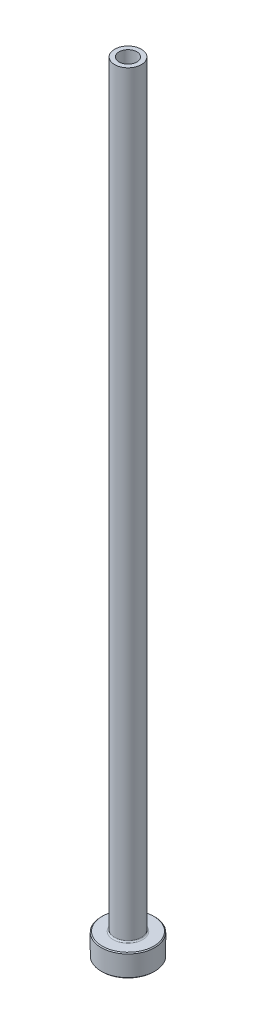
ISO-10303-21;
HEADER;
FILE_DESCRIPTION(('STEP AP214'),'2;1');
FILE_NAME('part.step','',(''),(''),'','','');
FILE_SCHEMA(('AUTOMOTIVE_DESIGN { 1 0 10303 214 1 1 1 1 }'));
ENDSEC;
DATA;
#1=APPLICATION_CONTEXT('core data for automotive mechanical design processes');
#2=APPLICATION_PROTOCOL_DEFINITION('international standard','automotive_design',2000,#1);
#3=PRODUCT_CONTEXT('',#1,'mechanical');
#4=PRODUCT('Part','Part','',(#3));
#5=PRODUCT_RELATED_PRODUCT_CATEGORY('part','',(#4));
#6=PRODUCT_DEFINITION_FORMATION('','',#4);
#7=PRODUCT_DEFINITION_CONTEXT('part definition',#1,'design');
#8=PRODUCT_DEFINITION('design','',#6,#7);
#9=PRODUCT_DEFINITION_SHAPE('','',#8);
#10=(LENGTH_UNIT() NAMED_UNIT(*) SI_UNIT(.MILLI.,.METRE.));
#11=(NAMED_UNIT(*) PLANE_ANGLE_UNIT() SI_UNIT($,.RADIAN.));
#12=(NAMED_UNIT(*) SI_UNIT($,.STERADIAN.) SOLID_ANGLE_UNIT());
#13=UNCERTAINTY_MEASURE_WITH_UNIT(LENGTH_MEASURE(1.E-05),#10,'distance_accuracy_value','');
#14=(GEOMETRIC_REPRESENTATION_CONTEXT(3) GLOBAL_UNCERTAINTY_ASSIGNED_CONTEXT((#13)) GLOBAL_UNIT_ASSIGNED_CONTEXT((#10,
#11,#12)) REPRESENTATION_CONTEXT('',''));
#15=CARTESIAN_POINT('',(0.,0.,0.));
#16=DIRECTION('',(0.,0.,1.));
#17=DIRECTION('',(1.,0.,0.));
#18=AXIS2_PLACEMENT_3D('',#15,#16,#17);
#19=CARTESIAN_POINT('',(0.,92.1876809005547,0.));
#20=DIRECTION('',(0.,1.,0.));
#21=DIRECTION('',(0.,0.,1.));
#22=AXIS2_PLACEMENT_3D('',#19,#20,#21);
#23=CYLINDRICAL_SURFACE('',#22,2.);
#24=CARTESIAN_POINT('',(0.,175.,0.));
#25=DIRECTION('',(0.,1.,0.));
#26=DIRECTION('',(0.,0.,1.));
#27=AXIS2_PLACEMENT_3D('',#24,#25,#26);
#28=CIRCLE('',#27,2.);
#29=CARTESIAN_POINT('',(0.,175.,2.));
#30=VERTEX_POINT('',#29);
#31=EDGE_CURVE('E62',#30,#30,#28,.T.);
#32=ORIENTED_EDGE('',*,*,#31,.T.);
#33=EDGE_LOOP('',(#32));
#34=FACE_BOUND('',#33,.T.);
#35=CARTESIAN_POINT('',(0.,130.,0.));
#36=DIRECTION('',(0.,1.,0.));
#37=DIRECTION('',(0.,0.,1.));
#38=AXIS2_PLACEMENT_3D('',#35,#36,#37);
#39=CIRCLE('',#38,2.);
#40=CARTESIAN_POINT('',(0.,130.,2.));
#41=VERTEX_POINT('',#40);
#42=EDGE_CURVE('E71',#41,#41,#39,.T.);
#43=ORIENTED_EDGE('',*,*,#42,.F.);
#44=EDGE_LOOP('',(#43));
#45=FACE_BOUND('',#44,.T.);
#46=ADVANCED_FACE('F30',(#34,#45),#23,.F.);
#47=CARTESIAN_POINT('',(-2.,175.,0.));
#48=DIRECTION('',(0.,1.,0.));
#49=DIRECTION('',(0.,0.,1.));
#50=AXIS2_PLACEMENT_3D('',#47,#48,#49);
#51=PLANE('',#50);
#52=CARTESIAN_POINT('',(0.,175.,0.));
#53=DIRECTION('',(0.,1.,0.));
#54=DIRECTION('',(0.,0.,1.));
#55=AXIS2_PLACEMENT_3D('',#52,#53,#54);
#56=CIRCLE('',#55,3.00000000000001);
#57=CARTESIAN_POINT('',(0.,175.,3.00000000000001));
#58=VERTEX_POINT('',#57);
#59=EDGE_CURVE('E65',#58,#58,#56,.T.);
#60=ORIENTED_EDGE('',*,*,#59,.T.);
#61=EDGE_LOOP('',(#60));
#62=FACE_BOUND('',#61,.T.);
#63=ORIENTED_EDGE('',*,*,#31,.F.);
#64=EDGE_LOOP('',(#63));
#65=FACE_BOUND('',#64,.T.);
#66=ADVANCED_FACE('F79',(#62,#65),#51,.T.);
#67=CARTESIAN_POINT('',(0.,92.1876809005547,0.));
#68=DIRECTION('',(0.,1.,0.));
#69=DIRECTION('',(0.,0.,1.));
#70=AXIS2_PLACEMENT_3D('',#67,#68,#69);
#71=CYLINDRICAL_SURFACE('',#70,3.);
#72=CARTESIAN_POINT('',(0.,5.3,0.));
#73=DIRECTION('',(0.,1.,0.));
#74=DIRECTION('',(0.,0.,1.));
#75=AXIS2_PLACEMENT_3D('',#72,#73,#74);
#76=CIRCLE('',#75,3.);
#77=CARTESIAN_POINT('',(0.,5.3,3.));
#78=VERTEX_POINT('',#77);
#79=EDGE_CURVE('E59',#78,#78,#76,.T.);
#80=ORIENTED_EDGE('',*,*,#79,.T.);
#81=EDGE_LOOP('',(#80));
#82=FACE_BOUND('',#81,.T.);
#83=ORIENTED_EDGE('',*,*,#59,.F.);
#84=EDGE_LOOP('',(#83));
#85=FACE_BOUND('',#84,.T.);
#86=ADVANCED_FACE('F85',(#82,#85),#71,.T.);
#87=CARTESIAN_POINT('',(-2.99999999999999,5.,0.));
#88=DIRECTION('',(0.,1.,0.));
#89=DIRECTION('',(0.,0.,1.));
#90=AXIS2_PLACEMENT_3D('',#87,#88,#89);
#91=PLANE('',#90);
#92=CARTESIAN_POINT('',(0.,5.,0.));
#93=DIRECTION('',(0.,1.,0.));
#94=DIRECTION('',(0.,0.,1.));
#95=AXIS2_PLACEMENT_3D('',#92,#93,#94);
#96=CIRCLE('',#95,5.79999999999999);
#97=CARTESIAN_POINT('',(0.,5.,5.79999999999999));
#98=VERTEX_POINT('',#97);
#99=EDGE_CURVE('E53',#98,#98,#96,.T.);
#100=ORIENTED_EDGE('',*,*,#99,.T.);
#101=EDGE_LOOP('',(#100));
#102=FACE_BOUND('',#101,.T.);
#103=CARTESIAN_POINT('',(0.,5.,0.));
#104=DIRECTION('',(0.,1.,0.));
#105=DIRECTION('',(0.,0.,1.));
#106=AXIS2_PLACEMENT_3D('',#103,#104,#105);
#107=CIRCLE('',#106,3.3);
#108=CARTESIAN_POINT('',(0.,5.,3.3));
#109=VERTEX_POINT('',#108);
#110=EDGE_CURVE('E56',#109,#109,#107,.F.);
#111=ORIENTED_EDGE('',*,*,#110,.T.);
#112=EDGE_LOOP('',(#111));
#113=FACE_BOUND('',#112,.T.);
#114=ADVANCED_FACE('F111',(#102,#113),#91,.T.);
#115=CARTESIAN_POINT('',(0.,92.1876809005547,0.));
#116=DIRECTION('',(0.,1.,0.));
#117=DIRECTION('',(0.,0.,1.));
#118=AXIS2_PLACEMENT_3D('',#115,#116,#117);
#119=CYLINDRICAL_SURFACE('',#118,5.99999999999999);
#120=CARTESIAN_POINT('',(0.,4.8,0.));
#121=DIRECTION('',(0.,1.,0.));
#122=DIRECTION('',(0.,0.,1.));
#123=AXIS2_PLACEMENT_3D('',#120,#121,#122);
#124=CIRCLE('',#123,5.99999999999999);
#125=CARTESIAN_POINT('',(0.,4.8,5.99999999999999));
#126=VERTEX_POINT('',#125);
#127=EDGE_CURVE('E45',#126,#126,#124,.F.);
#128=ORIENTED_EDGE('',*,*,#127,.T.);
#129=EDGE_LOOP('',(#128));
#130=FACE_BOUND('',#129,.T.);
#131=CARTESIAN_POINT('',(0.,0.200000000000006,0.));
#132=DIRECTION('',(0.,-1.,0.));
#133=DIRECTION('',(0.,0.,-1.));
#134=AXIS2_PLACEMENT_3D('',#131,#132,#133);
#135=CIRCLE('',#134,5.99999999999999);
#136=CARTESIAN_POINT('',(0.,0.200000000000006,-5.99999999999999));
#137=VERTEX_POINT('',#136);
#138=EDGE_CURVE('E50',#137,#137,#135,.F.);
#139=ORIENTED_EDGE('',*,*,#138,.T.);
#140=EDGE_LOOP('',(#139));
#141=FACE_BOUND('',#140,.T.);
#142=ADVANCED_FACE('F108',(#130,#141),#119,.T.);
#143=CARTESIAN_POINT('',(-5.99999999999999,0.,0.));
#144=DIRECTION('',(0.,-1.,0.));
#145=DIRECTION('',(0.,0.,-1.));
#146=AXIS2_PLACEMENT_3D('',#143,#144,#145);
#147=PLANE('',#146);
#148=CARTESIAN_POINT('',(0.,0.,0.));
#149=DIRECTION('',(0.,-1.,0.));
#150=DIRECTION('',(0.,0.,-1.));
#151=AXIS2_PLACEMENT_3D('',#148,#149,#150);
#152=CIRCLE('',#151,2.74999999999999);
#153=CARTESIAN_POINT('',(0.,0.,-2.74999999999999));
#154=VERTEX_POINT('',#153);
#155=EDGE_CURVE('E37',#154,#154,#152,.F.);
#156=ORIENTED_EDGE('',*,*,#155,.T.);
#157=EDGE_LOOP('',(#156));
#158=FACE_BOUND('',#157,.T.);
#159=CARTESIAN_POINT('',(0.,0.,0.));
#160=DIRECTION('',(0.,-1.,0.));
#161=DIRECTION('',(0.,0.,-1.));
#162=AXIS2_PLACEMENT_3D('',#159,#160,#161);
#163=CIRCLE('',#162,5.79999999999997);
#164=CARTESIAN_POINT('',(0.,0.,-5.79999999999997));
#165=VERTEX_POINT('',#164);
#166=EDGE_CURVE('E41',#165,#165,#163,.T.);
#167=ORIENTED_EDGE('',*,*,#166,.T.);
#168=EDGE_LOOP('',(#167));
#169=FACE_BOUND('',#168,.T.);
#170=ADVANCED_FACE('F110',(#158,#169),#147,.T.);
#171=CARTESIAN_POINT('',(0.,92.1876809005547,0.));
#172=DIRECTION('',(0.,1.,0.));
#173=DIRECTION('',(0.,0.,1.));
#174=AXIS2_PLACEMENT_3D('',#171,#172,#173);
#175=CYLINDRICAL_SURFACE('',#174,2.25);
#176=CARTESIAN_POINT('',(0.,0.5,0.));
#177=DIRECTION('',(0.,-1.,0.));
#178=DIRECTION('',(0.,0.,-1.));
#179=AXIS2_PLACEMENT_3D('',#176,#177,#178);
#180=CIRCLE('',#179,2.25);
#181=CARTESIAN_POINT('',(0.,0.5,-2.25));
#182=VERTEX_POINT('',#181);
#183=EDGE_CURVE('E10',#182,#182,#180,.T.);
#184=ORIENTED_EDGE('',*,*,#183,.T.);
#185=EDGE_LOOP('',(#184));
#186=FACE_BOUND('',#185,.T.);
#187=CARTESIAN_POINT('',(0.,118.,0.));
#188=DIRECTION('',(0.,1.,0.));
#189=DIRECTION('',(0.,0.,1.));
#190=AXIS2_PLACEMENT_3D('',#187,#188,#189);
#191=CIRCLE('',#190,2.25);
#192=CARTESIAN_POINT('',(0.,118.,2.25));
#193=VERTEX_POINT('',#192);
#194=EDGE_CURVE('E68',#193,#193,#191,.T.);
#195=ORIENTED_EDGE('',*,*,#194,.T.);
#196=EDGE_LOOP('',(#195));
#197=FACE_BOUND('',#196,.T.);
#198=ADVANCED_FACE('F118',(#186,#197),#175,.F.);
#199=CARTESIAN_POINT('',(0.,118.,0.));
#200=DIRECTION('',(0.,-1.,0.));
#201=DIRECTION('',(0.,0.,-1.));
#202=AXIS2_PLACEMENT_3D('',#199,#200,#201);
#203=CONICAL_SURFACE('',#202,2.25,0.0208303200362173);
#204=ORIENTED_EDGE('',*,*,#42,.T.);
#205=EDGE_LOOP('',(#204));
#206=FACE_BOUND('',#205,.T.);
#207=ORIENTED_EDGE('',*,*,#194,.F.);
#208=EDGE_LOOP('',(#207));
#209=FACE_BOUND('',#208,.T.);
#210=ADVANCED_FACE('F75',(#206,#209),#203,.F.);
#211=CARTESIAN_POINT('',(0.,5.3,0.));
#212=DIRECTION('',(0.,1.,0.));
#213=DIRECTION('',(0.,0.,1.));
#214=AXIS2_PLACEMENT_3D('',#211,#212,#213);
#215=TOROIDAL_SURFACE('',#214,3.3,0.3);
#216=ORIENTED_EDGE('',*,*,#110,.F.);
#217=EDGE_LOOP('',(#216));
#218=FACE_BOUND('',#217,.T.);
#219=ORIENTED_EDGE('',*,*,#79,.F.);
#220=EDGE_LOOP('',(#219));
#221=FACE_BOUND('',#220,.T.);
#222=ADVANCED_FACE('F90',(#218,#221),#215,.F.);
#223=CARTESIAN_POINT('',(0.,5.,0.));
#224=DIRECTION('',(0.,-1.,0.));
#225=DIRECTION('',(0.,0.,-1.));
#226=AXIS2_PLACEMENT_3D('',#223,#224,#225);
#227=CONICAL_SURFACE('',#226,5.79999999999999,0.785398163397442);
#228=ORIENTED_EDGE('',*,*,#127,.F.);
#229=EDGE_LOOP('',(#228));
#230=FACE_BOUND('',#229,.T.);
#231=ORIENTED_EDGE('',*,*,#99,.F.);
#232=EDGE_LOOP('',(#231));
#233=FACE_BOUND('',#232,.T.);
#234=ADVANCED_FACE('F93',(#230,#233),#227,.T.);
#235=CARTESIAN_POINT('',(0.,0.200000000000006,0.));
#236=DIRECTION('',(0.,1.,0.));
#237=DIRECTION('',(0.,0.,1.));
#238=AXIS2_PLACEMENT_3D('',#235,#236,#237);
#239=CONICAL_SURFACE('',#238,5.99999999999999,0.785398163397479);
#240=ORIENTED_EDGE('',*,*,#166,.F.);
#241=EDGE_LOOP('',(#240));
#242=FACE_BOUND('',#241,.T.);
#243=ORIENTED_EDGE('',*,*,#138,.F.);
#244=EDGE_LOOP('',(#243));
#245=FACE_BOUND('',#244,.T.);
#246=ADVANCED_FACE('F96',(#242,#245),#239,.T.);
#247=CARTESIAN_POINT('',(0.,0.,0.));
#248=DIRECTION('',(0.,-1.,0.));
#249=DIRECTION('',(0.,0.,-1.));
#250=AXIS2_PLACEMENT_3D('',#247,#248,#249);
#251=CONICAL_SURFACE('',#250,2.74999999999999,0.785398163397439);
#252=ORIENTED_EDGE('',*,*,#183,.F.);
#253=EDGE_LOOP('',(#252));
#254=FACE_BOUND('',#253,.T.);
#255=ORIENTED_EDGE('',*,*,#155,.F.);
#256=EDGE_LOOP('',(#255));
#257=FACE_BOUND('',#256,.T.);
#258=ADVANCED_FACE('F32',(#254,#257),#251,.F.);
#259=CLOSED_SHELL('',(#46,#66,#86,#114,#142,#170,#198,#210,#222,#234,#246,#258));
#260=MANIFOLD_SOLID_BREP('B2',#259);
#261=ADVANCED_BREP_SHAPE_REPRESENTATION('',(#18,#260),#14);
#262=SHAPE_DEFINITION_REPRESENTATION(#9,#261);
ENDSEC;
END-ISO-10303-21;
